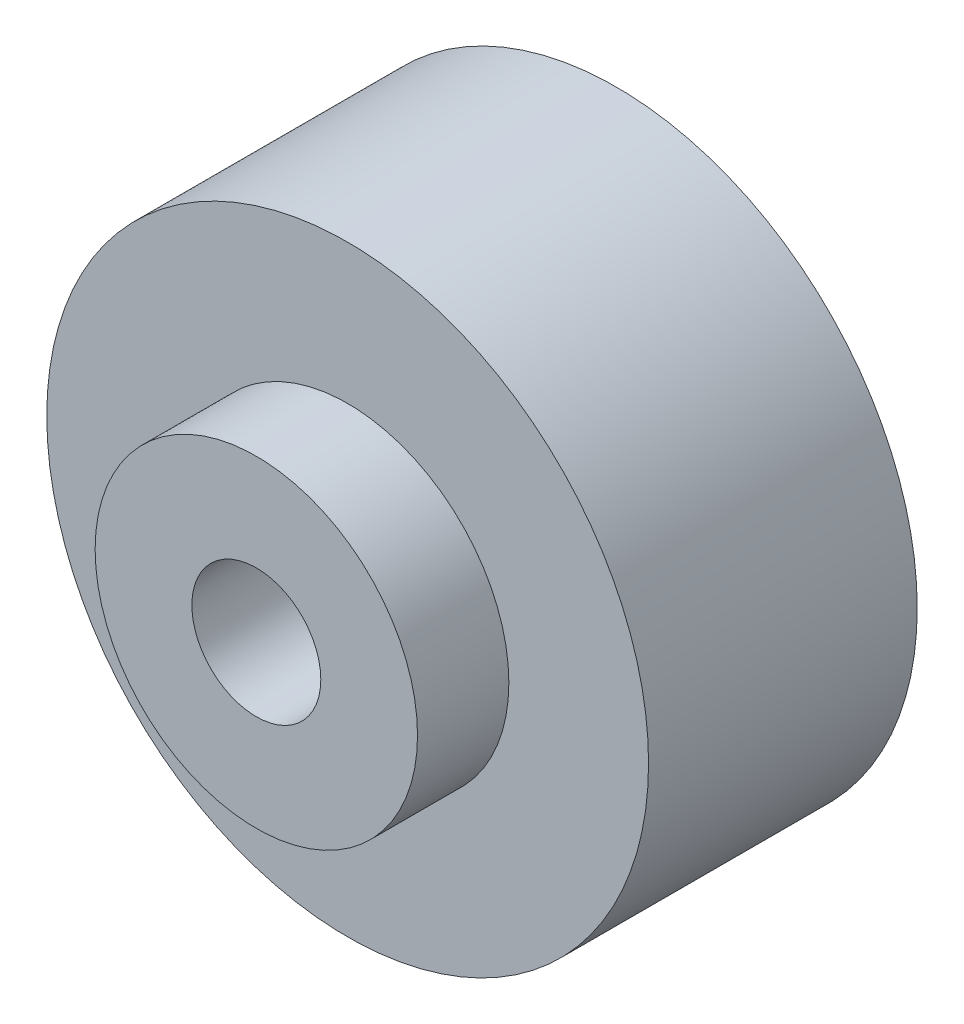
from build123d import *

# Parameters (mm, degrees)
SKETCH1_R           = 15
SKETCH1_R_2         = 6
BOSS_EXTRUDE1_DEPTH = 8.5
SKETCH1_3_R         = 28
SKETCH1_3_R_2       = 15
SKETCH1_3_R_3       = 6
BOSS_EXTRUDE2_DEPTH = 25


with BuildPart() as part:
    # Sketch1 → Boss-Extrude1 (new body)
    with BuildSketch(Plane.XY):
        Circle(SKETCH1_R)
        Circle(SKETCH1_R_2, mode=Mode.SUBTRACT)
    extrude(amount=BOSS_EXTRUDE1_DEPTH)


with BuildPart() as body_2:
    # Sketch1_3 → Boss-Extrude2 (new body)
    # profile 1 of 2: a face of its own
    with BuildSketch(Plane.XY):
        Circle(SKETCH1_3_R)
        Circle(SKETCH1_3_R_2, mode=Mode.SUBTRACT)
    # profile 2 of 2: a face of its own
    with BuildSketch(Plane.XY):
        Circle(SKETCH1_3_R_2)
        Circle(SKETCH1_3_R_3, mode=Mode.SUBTRACT)
    extrude(amount=-BOSS_EXTRUDE2_DEPTH)


solid = Compound([part.part, body_2.part])
